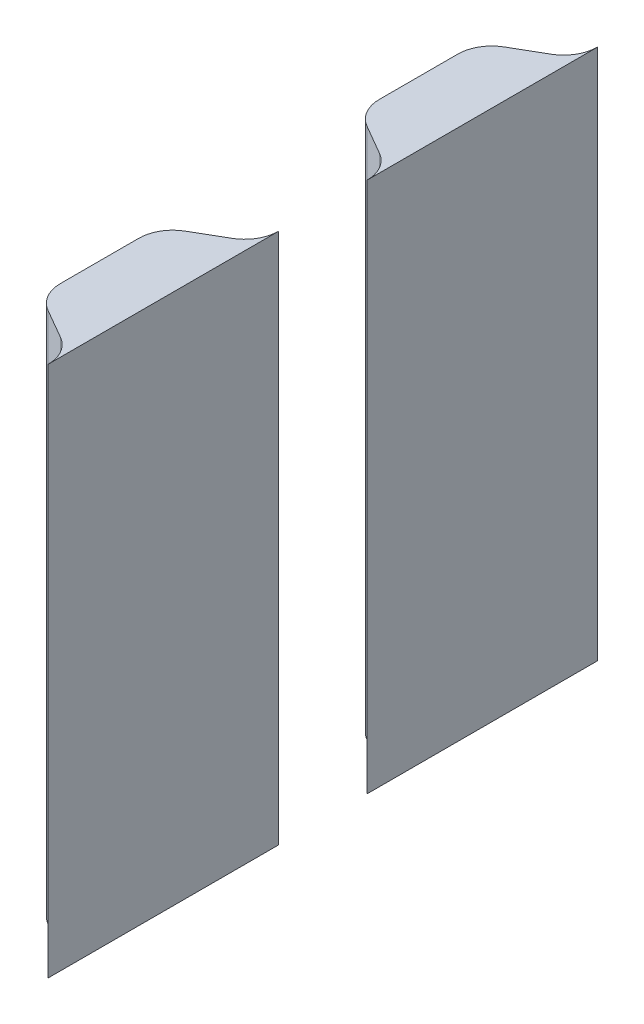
ISO-10303-21;
HEADER;
FILE_DESCRIPTION(('STEP AP214'),'2;1');
FILE_NAME('part.step','',(''),(''),'','','');
FILE_SCHEMA(('AUTOMOTIVE_DESIGN { 1 0 10303 214 1 1 1 1 }'));
ENDSEC;
DATA;
#1=APPLICATION_CONTEXT('core data for automotive mechanical design processes');
#2=APPLICATION_PROTOCOL_DEFINITION('international standard','automotive_design',2000,#1);
#3=PRODUCT_CONTEXT('',#1,'mechanical');
#4=PRODUCT('Part','Part','',(#3));
#5=PRODUCT_RELATED_PRODUCT_CATEGORY('part','',(#4));
#6=PRODUCT_DEFINITION_FORMATION('','',#4);
#7=PRODUCT_DEFINITION_CONTEXT('part definition',#1,'design');
#8=PRODUCT_DEFINITION('design','',#6,#7);
#9=PRODUCT_DEFINITION_SHAPE('','',#8);
#10=(LENGTH_UNIT() NAMED_UNIT(*) SI_UNIT(.MILLI.,.METRE.));
#11=(NAMED_UNIT(*) PLANE_ANGLE_UNIT() SI_UNIT($,.RADIAN.));
#12=(NAMED_UNIT(*) SI_UNIT($,.STERADIAN.) SOLID_ANGLE_UNIT());
#13=UNCERTAINTY_MEASURE_WITH_UNIT(LENGTH_MEASURE(1.E-05),#10,'distance_accuracy_value','');
#14=(GEOMETRIC_REPRESENTATION_CONTEXT(3) GLOBAL_UNCERTAINTY_ASSIGNED_CONTEXT((#13)) GLOBAL_UNIT_ASSIGNED_CONTEXT((#10,
#11,#12)) REPRESENTATION_CONTEXT('',''));
#15=CARTESIAN_POINT('',(0.,0.,0.));
#16=DIRECTION('',(0.,0.,1.));
#17=DIRECTION('',(1.,0.,0.));
#18=AXIS2_PLACEMENT_3D('',#15,#16,#17);
#19=CARTESIAN_POINT('',(46.0089834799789,25.,-26.1067492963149));
#20=DIRECTION('',(0.501345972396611,0.,-0.865246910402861));
#21=DIRECTION('',(-0.865246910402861,0.,-0.501345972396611));
#22=AXIS2_PLACEMENT_3D('',#19,#20,#21);
#23=PLANE('',#22);
#24=DIRECTION('',(0.865246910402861,0.,0.501345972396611));
#25=VECTOR('',#24,1.);
#26=CARTESIAN_POINT('',(46.0089834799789,0.,-26.1067492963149));
#27=LINE('',#26,#25);
#28=CARTESIAN_POINT('',(57.7978464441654,0.,-19.2759835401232));
#29=VERTEX_POINT('',#28);
#30=CARTESIAN_POINT('',(59.2021535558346,0.,-18.4622924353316));
#31=VERTEX_POINT('',#30);
#32=EDGE_CURVE('E104',#29,#31,#27,.T.);
#33=ORIENTED_EDGE('',*,*,#32,.T.);
#34=DIRECTION('',(0.,-1.,0.));
#35=VECTOR('',#34,1.);
#36=CARTESIAN_POINT('',(59.2021535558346,25.,-18.4622924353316));
#37=LINE('',#36,#35);
#38=CARTESIAN_POINT('',(59.2021535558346,25.,-18.4622924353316));
#39=VERTEX_POINT('',#38);
#40=EDGE_CURVE('E12',#39,#31,#37,.T.);
#41=ORIENTED_EDGE('',*,*,#40,.F.);
#42=DIRECTION('',(0.865246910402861,0.,0.501345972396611));
#43=VECTOR('',#42,1.);
#44=CARTESIAN_POINT('',(46.0089834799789,25.,-26.1067492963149));
#45=LINE('',#44,#43);
#46=CARTESIAN_POINT('',(57.7978464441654,25.,-19.2759835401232));
#47=VERTEX_POINT('',#46);
#48=EDGE_CURVE('E131',#47,#39,#45,.T.);
#49=ORIENTED_EDGE('',*,*,#48,.F.);
#50=DIRECTION('',(0.,-1.,0.));
#51=VECTOR('',#50,1.);
#52=CARTESIAN_POINT('',(57.7978464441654,25.,-19.2759835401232));
#53=LINE('',#52,#51);
#54=EDGE_CURVE('E117',#47,#29,#53,.T.);
#55=ORIENTED_EDGE('',*,*,#54,.T.);
#56=EDGE_LOOP('',(#33,#41,#49,#55));
#57=FACE_BOUND('',#56,.T.);
#58=ADVANCED_FACE('F36',(#57),#23,.F.);
#59=CARTESIAN_POINT('',(58.4,25.,-17.077897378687));
#60=DIRECTION('',(0.,-1.,0.));
#61=DIRECTION('',(0.,0.,-1.));
#62=AXIS2_PLACEMENT_3D('',#59,#60,#61);
#63=CYLINDRICAL_SURFACE('',#62,1.6);
#64=CARTESIAN_POINT('',(58.4,0.,-17.077897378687));
#65=DIRECTION('',(0.,1.,0.));
#66=DIRECTION('',(0.,0.,1.));
#67=AXIS2_PLACEMENT_3D('',#64,#65,#66);
#68=CIRCLE('',#67,1.6);
#69=CARTESIAN_POINT('',(60.,0.,-17.077897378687));
#70=VERTEX_POINT('',#69);
#71=EDGE_CURVE('E100',#31,#70,#68,.F.);
#72=ORIENTED_EDGE('',*,*,#71,.T.);
#73=DIRECTION('',(0.,-1.,0.));
#74=VECTOR('',#73,1.);
#75=CARTESIAN_POINT('',(60.,25.,-17.077897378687));
#76=LINE('',#75,#74);
#77=CARTESIAN_POINT('',(60.,25.,-17.077897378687));
#78=VERTEX_POINT('',#77);
#79=EDGE_CURVE('E43',#78,#70,#76,.T.);
#80=ORIENTED_EDGE('',*,*,#79,.F.);
#81=CARTESIAN_POINT('',(58.4,25.,-17.077897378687));
#82=DIRECTION('',(0.,1.,0.));
#83=DIRECTION('',(0.,0.,1.));
#84=AXIS2_PLACEMENT_3D('',#81,#82,#83);
#85=CIRCLE('',#84,1.6);
#86=EDGE_CURVE('E113',#39,#78,#85,.F.);
#87=ORIENTED_EDGE('',*,*,#86,.F.);
#88=ORIENTED_EDGE('',*,*,#40,.T.);
#89=EDGE_LOOP('',(#72,#80,#87,#88));
#90=FACE_BOUND('',#89,.T.);
#91=ADVANCED_FACE('F112',(#90),#63,.F.);
#92=CARTESIAN_POINT('',(60.,25.,-14.9999401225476));
#93=DIRECTION('',(-1.,0.,0.));
#94=DIRECTION('',(0.,0.,1.));
#95=AXIS2_PLACEMENT_3D('',#92,#93,#94);
#96=PLANE('',#95);
#97=DIRECTION('',(0.,0.,-1.));
#98=VECTOR('',#97,1.);
#99=CARTESIAN_POINT('',(60.,0.,-14.9999401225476));
#100=LINE('',#99,#98);
#101=CARTESIAN_POINT('',(60.,0.,-27.9237604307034));
#102=VERTEX_POINT('',#101);
#103=EDGE_CURVE('E106',#70,#102,#100,.T.);
#104=ORIENTED_EDGE('',*,*,#103,.T.);
#105=DIRECTION('',(0.,-1.,0.));
#106=VECTOR('',#105,1.);
#107=CARTESIAN_POINT('',(60.,25.,-27.9237604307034));
#108=LINE('',#107,#106);
#109=CARTESIAN_POINT('',(60.,25.,-27.9237604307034));
#110=VERTEX_POINT('',#109);
#111=EDGE_CURVE('E157',#110,#102,#108,.T.);
#112=ORIENTED_EDGE('',*,*,#111,.F.);
#113=DIRECTION('',(0.,0.,-1.));
#114=VECTOR('',#113,1.);
#115=CARTESIAN_POINT('',(60.,25.,-14.9999401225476));
#116=LINE('',#115,#114);
#117=EDGE_CURVE('E134',#78,#110,#116,.T.);
#118=ORIENTED_EDGE('',*,*,#117,.F.);
#119=ORIENTED_EDGE('',*,*,#79,.T.);
#120=EDGE_LOOP('',(#104,#112,#118,#119));
#121=FACE_BOUND('',#120,.T.);
#122=ADVANCED_FACE('F161',(#121),#96,.F.);
#123=CARTESIAN_POINT('',(58.4,25.,-27.9237604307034));
#124=DIRECTION('',(0.,-1.,0.));
#125=DIRECTION('',(0.,0.,-1.));
#126=AXIS2_PLACEMENT_3D('',#123,#124,#125);
#127=CYLINDRICAL_SURFACE('',#126,1.6);
#128=CARTESIAN_POINT('',(58.4,0.,-27.9237604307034));
#129=DIRECTION('',(0.,1.,0.));
#130=DIRECTION('',(0.,0.,1.));
#131=AXIS2_PLACEMENT_3D('',#128,#129,#130);
#132=CIRCLE('',#131,1.6);
#133=CARTESIAN_POINT('',(59.2,0.,-26.5381197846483));
#134=VERTEX_POINT('',#133);
#135=EDGE_CURVE('E121',#102,#134,#132,.F.);
#136=ORIENTED_EDGE('',*,*,#135,.T.);
#137=DIRECTION('',(0.,-1.,0.));
#138=VECTOR('',#137,1.);
#139=CARTESIAN_POINT('',(59.2,25.,-26.5381197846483));
#140=LINE('',#139,#138);
#141=CARTESIAN_POINT('',(59.2,25.,-26.5381197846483));
#142=VERTEX_POINT('',#141);
#143=EDGE_CURVE('E154',#142,#134,#140,.T.);
#144=ORIENTED_EDGE('',*,*,#143,.F.);
#145=CARTESIAN_POINT('',(58.4,25.,-27.9237604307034));
#146=DIRECTION('',(0.,1.,0.));
#147=DIRECTION('',(0.,0.,1.));
#148=AXIS2_PLACEMENT_3D('',#145,#146,#147);
#149=CIRCLE('',#148,1.6);
#150=EDGE_CURVE('E136',#110,#142,#149,.F.);
#151=ORIENTED_EDGE('',*,*,#150,.F.);
#152=ORIENTED_EDGE('',*,*,#111,.T.);
#153=EDGE_LOOP('',(#136,#144,#151,#152));
#154=FACE_BOUND('',#153,.T.);
#155=ADVANCED_FACE('F169',(#154),#127,.F.);
#156=CARTESIAN_POINT('',(39.4838843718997,25.,-15.1550151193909));
#157=DIRECTION('',(0.5,0.,0.866025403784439));
#158=DIRECTION('',(0.866025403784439,0.,-0.5));
#159=AXIS2_PLACEMENT_3D('',#156,#157,#158);
#160=PLANE('',#159);
#161=DIRECTION('',(-0.866025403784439,0.,0.5));
#162=VECTOR('',#161,1.);
#163=CARTESIAN_POINT('',(39.4838843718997,0.,-15.1550151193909));
#164=LINE('',#163,#162);
#165=CARTESIAN_POINT('',(57.8,0.,-25.7298294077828));
#166=VERTEX_POINT('',#165);
#167=EDGE_CURVE('E123',#134,#166,#164,.T.);
#168=ORIENTED_EDGE('',*,*,#167,.T.);
#169=DIRECTION('',(0.,-1.,0.));
#170=VECTOR('',#169,1.);
#171=CARTESIAN_POINT('',(57.8,25.,-25.7298294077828));
#172=LINE('',#171,#170);
#173=CARTESIAN_POINT('',(57.8,25.,-25.7298294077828));
#174=VERTEX_POINT('',#173);
#175=EDGE_CURVE('E151',#174,#166,#172,.T.);
#176=ORIENTED_EDGE('',*,*,#175,.F.);
#177=DIRECTION('',(-0.866025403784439,0.,0.5));
#178=VECTOR('',#177,1.);
#179=CARTESIAN_POINT('',(39.4838843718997,25.,-15.1550151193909));
#180=LINE('',#179,#178);
#181=EDGE_CURVE('E138',#142,#174,#180,.T.);
#182=ORIENTED_EDGE('',*,*,#181,.F.);
#183=ORIENTED_EDGE('',*,*,#143,.T.);
#184=EDGE_LOOP('',(#168,#176,#182,#183));
#185=FACE_BOUND('',#184,.T.);
#186=ADVANCED_FACE('F172',(#185),#160,.F.);
#187=CARTESIAN_POINT('',(58.6,25.,-24.3441887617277));
#188=DIRECTION('',(0.,-1.,0.));
#189=DIRECTION('',(0.,0.,-1.));
#190=AXIS2_PLACEMENT_3D('',#187,#188,#189);
#191=CYLINDRICAL_SURFACE('',#190,1.6);
#192=CARTESIAN_POINT('',(58.6,0.,-24.3441887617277));
#193=DIRECTION('',(0.,1.,0.));
#194=DIRECTION('',(0.,0.,1.));
#195=AXIS2_PLACEMENT_3D('',#192,#193,#194);
#196=CIRCLE('',#195,1.6);
#197=CARTESIAN_POINT('',(57.,0.,-24.3441887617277));
#198=VERTEX_POINT('',#197);
#199=EDGE_CURVE('E125',#166,#198,#196,.T.);
#200=ORIENTED_EDGE('',*,*,#199,.T.);
#201=DIRECTION('',(0.,-1.,0.));
#202=VECTOR('',#201,1.);
#203=CARTESIAN_POINT('',(57.,25.,-24.3441887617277));
#204=LINE('',#203,#202);
#205=CARTESIAN_POINT('',(57.,25.,-24.3441887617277));
#206=VERTEX_POINT('',#205);
#207=EDGE_CURVE('E148',#206,#198,#204,.T.);
#208=ORIENTED_EDGE('',*,*,#207,.F.);
#209=CARTESIAN_POINT('',(58.6,25.,-24.3441887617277));
#210=DIRECTION('',(0.,1.,0.));
#211=DIRECTION('',(0.,0.,1.));
#212=AXIS2_PLACEMENT_3D('',#209,#210,#211);
#213=CIRCLE('',#212,1.6);
#214=EDGE_CURVE('E140',#174,#206,#213,.T.);
#215=ORIENTED_EDGE('',*,*,#214,.F.);
#216=ORIENTED_EDGE('',*,*,#175,.T.);
#217=EDGE_LOOP('',(#200,#208,#215,#216));
#218=FACE_BOUND('',#217,.T.);
#219=ADVANCED_FACE('F177',(#218),#191,.T.);
#220=CARTESIAN_POINT('',(57.,25.,-14.9999401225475));
#221=DIRECTION('',(1.,0.,0.));
#222=DIRECTION('',(0.,0.,-1.));
#223=AXIS2_PLACEMENT_3D('',#220,#221,#222);
#224=PLANE('',#223);
#225=DIRECTION('',(0.,0.,1.));
#226=VECTOR('',#225,1.);
#227=CARTESIAN_POINT('',(57.,0.,-14.9999401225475));
#228=LINE('',#227,#226);
#229=CARTESIAN_POINT('',(57.,0.,-20.6603785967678));
#230=VERTEX_POINT('',#229);
#231=EDGE_CURVE('E127',#198,#230,#228,.T.);
#232=ORIENTED_EDGE('',*,*,#231,.T.);
#233=DIRECTION('',(0.,-1.,0.));
#234=VECTOR('',#233,1.);
#235=CARTESIAN_POINT('',(57.,25.,-20.6603785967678));
#236=LINE('',#235,#234);
#237=CARTESIAN_POINT('',(57.,25.,-20.6603785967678));
#238=VERTEX_POINT('',#237);
#239=EDGE_CURVE('E145',#238,#230,#236,.T.);
#240=ORIENTED_EDGE('',*,*,#239,.F.);
#241=DIRECTION('',(0.,0.,1.));
#242=VECTOR('',#241,1.);
#243=CARTESIAN_POINT('',(57.,25.,-14.9999401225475));
#244=LINE('',#243,#242);
#245=EDGE_CURVE('E55',#206,#238,#244,.T.);
#246=ORIENTED_EDGE('',*,*,#245,.F.);
#247=ORIENTED_EDGE('',*,*,#207,.T.);
#248=EDGE_LOOP('',(#232,#240,#246,#247));
#249=FACE_BOUND('',#248,.T.);
#250=ADVANCED_FACE('F180',(#249),#224,.F.);
#251=CARTESIAN_POINT('',(58.6,25.,-20.6603785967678));
#252=DIRECTION('',(0.,-1.,0.));
#253=DIRECTION('',(0.,0.,-1.));
#254=AXIS2_PLACEMENT_3D('',#251,#252,#253);
#255=CYLINDRICAL_SURFACE('',#254,1.6);
#256=CARTESIAN_POINT('',(58.6,0.,-20.6603785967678));
#257=DIRECTION('',(0.,1.,0.));
#258=DIRECTION('',(0.,0.,1.));
#259=AXIS2_PLACEMENT_3D('',#256,#257,#258);
#260=CIRCLE('',#259,1.6);
#261=EDGE_CURVE('E129',#230,#29,#260,.T.);
#262=ORIENTED_EDGE('',*,*,#261,.T.);
#263=ORIENTED_EDGE('',*,*,#54,.F.);
#264=CARTESIAN_POINT('',(58.6,25.,-20.6603785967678));
#265=DIRECTION('',(0.,1.,0.));
#266=DIRECTION('',(0.,0.,1.));
#267=AXIS2_PLACEMENT_3D('',#264,#265,#266);
#268=CIRCLE('',#267,1.6);
#269=EDGE_CURVE('E50',#238,#47,#268,.T.);
#270=ORIENTED_EDGE('',*,*,#269,.F.);
#271=ORIENTED_EDGE('',*,*,#239,.T.);
#272=EDGE_LOOP('',(#262,#263,#270,#271));
#273=FACE_BOUND('',#272,.T.);
#274=ADVANCED_FACE('F182',(#273),#255,.T.);
#275=CARTESIAN_POINT('',(39.5734169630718,25.,-14.9999401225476));
#276=DIRECTION('',(0.,1.,0.));
#277=DIRECTION('',(0.,0.,1.));
#278=AXIS2_PLACEMENT_3D('',#275,#276,#277);
#279=PLANE('',#278);
#280=ORIENTED_EDGE('',*,*,#48,.T.);
#281=ORIENTED_EDGE('',*,*,#86,.T.);
#282=ORIENTED_EDGE('',*,*,#117,.T.);
#283=ORIENTED_EDGE('',*,*,#150,.T.);
#284=ORIENTED_EDGE('',*,*,#181,.T.);
#285=ORIENTED_EDGE('',*,*,#214,.T.);
#286=ORIENTED_EDGE('',*,*,#245,.T.);
#287=ORIENTED_EDGE('',*,*,#269,.T.);
#288=EDGE_LOOP('',(#280,#281,#282,#283,#284,#285,#286,#287));
#289=FACE_BOUND('',#288,.T.);
#290=ADVANCED_FACE('F164',(#289),#279,.T.);
#291=CARTESIAN_POINT('',(39.5734169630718,0.,-14.9999401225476));
#292=DIRECTION('',(0.,1.,0.));
#293=DIRECTION('',(0.,0.,1.));
#294=AXIS2_PLACEMENT_3D('',#291,#292,#293);
#295=PLANE('',#294);
#296=ORIENTED_EDGE('',*,*,#32,.F.);
#297=ORIENTED_EDGE('',*,*,#261,.F.);
#298=ORIENTED_EDGE('',*,*,#231,.F.);
#299=ORIENTED_EDGE('',*,*,#199,.F.);
#300=ORIENTED_EDGE('',*,*,#167,.F.);
#301=ORIENTED_EDGE('',*,*,#135,.F.);
#302=ORIENTED_EDGE('',*,*,#103,.F.);
#303=ORIENTED_EDGE('',*,*,#71,.F.);
#304=EDGE_LOOP('',(#296,#297,#298,#299,#300,#301,#302,#303));
#305=FACE_BOUND('',#304,.T.);
#306=ADVANCED_FACE('F101',(#305),#295,.F.);
#307=CLOSED_SHELL('',(#58,#91,#122,#155,#186,#219,#250,#274,#290,#306));
#308=MANIFOLD_SOLID_BREP('B2',#307);
#309=CARTESIAN_POINT('',(58.6,25.,-9.33962140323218));
#310=DIRECTION('',(0.,-1.,0.));
#311=DIRECTION('',(0.,0.,-1.));
#312=AXIS2_PLACEMENT_3D('',#309,#310,#311);
#313=CYLINDRICAL_SURFACE('',#312,1.6);
#314=CARTESIAN_POINT('',(58.6,0.,-9.33962140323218));
#315=DIRECTION('',(0.,1.,0.));
#316=DIRECTION('',(0.,0.,1.));
#317=AXIS2_PLACEMENT_3D('',#314,#315,#316);
#318=CIRCLE('',#317,1.6);
#319=CARTESIAN_POINT('',(57.,0.,-9.33962140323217));
#320=VERTEX_POINT('',#319);
#321=CARTESIAN_POINT('',(57.7978464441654,0.,-10.7240164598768));
#322=VERTEX_POINT('',#321);
#323=EDGE_CURVE('E318',#320,#322,#318,.F.);
#324=ORIENTED_EDGE('',*,*,#323,.F.);
#325=DIRECTION('',(0.,-1.,0.));
#326=VECTOR('',#325,1.);
#327=CARTESIAN_POINT('',(57.,25.,-9.33962140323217));
#328=LINE('',#327,#326);
#329=CARTESIAN_POINT('',(57.,25.,-9.33962140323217));
#330=VERTEX_POINT('',#329);
#331=EDGE_CURVE('E34',#330,#320,#328,.T.);
#332=ORIENTED_EDGE('',*,*,#331,.F.);
#333=CARTESIAN_POINT('',(58.6,25.,-9.33962140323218));
#334=DIRECTION('',(0.,1.,0.));
#335=DIRECTION('',(0.,0.,1.));
#336=AXIS2_PLACEMENT_3D('',#333,#334,#335);
#337=CIRCLE('',#336,1.6);
#338=CARTESIAN_POINT('',(57.7978464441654,25.,-10.7240164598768));
#339=VERTEX_POINT('',#338);
#340=EDGE_CURVE('E342',#330,#339,#337,.F.);
#341=ORIENTED_EDGE('',*,*,#340,.T.);
#342=DIRECTION('',(0.,-1.,0.));
#343=VECTOR('',#342,1.);
#344=CARTESIAN_POINT('',(57.7978464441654,25.,-10.7240164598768));
#345=LINE('',#344,#343);
#346=EDGE_CURVE('E257',#339,#322,#345,.T.);
#347=ORIENTED_EDGE('',*,*,#346,.T.);
#348=EDGE_LOOP('',(#324,#332,#341,#347));
#349=FACE_BOUND('',#348,.T.);
#350=ADVANCED_FACE('F243',(#349),#313,.T.);
#351=CARTESIAN_POINT('',(57.,25.,-14.9999401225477));
#352=DIRECTION('',(-1.,0.,0.));
#353=DIRECTION('',(0.,0.,1.));
#354=AXIS2_PLACEMENT_3D('',#351,#352,#353);
#355=PLANE('',#354);
#356=DIRECTION('',(0.,0.,-1.));
#357=VECTOR('',#356,1.);
#358=CARTESIAN_POINT('',(57.,0.,-14.9999401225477));
#359=LINE('',#358,#357);
#360=CARTESIAN_POINT('',(57.,0.,-5.65581123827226));
#361=VERTEX_POINT('',#360);
#362=EDGE_CURVE('E311',#361,#320,#359,.T.);
#363=ORIENTED_EDGE('',*,*,#362,.F.);
#364=DIRECTION('',(0.,-1.,0.));
#365=VECTOR('',#364,1.);
#366=CARTESIAN_POINT('',(57.,25.,-5.65581123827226));
#367=LINE('',#366,#365);
#368=CARTESIAN_POINT('',(57.,25.,-5.65581123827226));
#369=VERTEX_POINT('',#368);
#370=EDGE_CURVE('E250',#369,#361,#367,.T.);
#371=ORIENTED_EDGE('',*,*,#370,.F.);
#372=DIRECTION('',(0.,0.,-1.));
#373=VECTOR('',#372,1.);
#374=CARTESIAN_POINT('',(57.,25.,-14.9999401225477));
#375=LINE('',#374,#373);
#376=EDGE_CURVE('E314',#369,#330,#375,.T.);
#377=ORIENTED_EDGE('',*,*,#376,.T.);
#378=ORIENTED_EDGE('',*,*,#331,.T.);
#379=EDGE_LOOP('',(#363,#371,#377,#378));
#380=FACE_BOUND('',#379,.T.);
#381=ADVANCED_FACE('F309',(#380),#355,.T.);
#382=CARTESIAN_POINT('',(58.6,25.,-5.65581123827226));
#383=DIRECTION('',(0.,-1.,0.));
#384=DIRECTION('',(0.,0.,-1.));
#385=AXIS2_PLACEMENT_3D('',#382,#383,#384);
#386=CYLINDRICAL_SURFACE('',#385,1.59999999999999);
#387=CARTESIAN_POINT('',(58.6,0.,-5.65581123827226));
#388=DIRECTION('',(0.,1.,0.));
#389=DIRECTION('',(0.,0.,1.));
#390=AXIS2_PLACEMENT_3D('',#387,#388,#389);
#391=CIRCLE('',#390,1.59999999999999);
#392=CARTESIAN_POINT('',(57.8,0.,-4.27017059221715));
#393=VERTEX_POINT('',#392);
#394=EDGE_CURVE('E325',#393,#361,#391,.F.);
#395=ORIENTED_EDGE('',*,*,#394,.F.);
#396=DIRECTION('',(0.,-1.,0.));
#397=VECTOR('',#396,1.);
#398=CARTESIAN_POINT('',(57.8,25.,-4.27017059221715));
#399=LINE('',#398,#397);
#400=CARTESIAN_POINT('',(57.8,25.,-4.27017059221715));
#401=VERTEX_POINT('',#400);
#402=EDGE_CURVE('E368',#401,#393,#399,.T.);
#403=ORIENTED_EDGE('',*,*,#402,.F.);
#404=CARTESIAN_POINT('',(58.6,25.,-5.65581123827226));
#405=DIRECTION('',(0.,1.,0.));
#406=DIRECTION('',(0.,0.,1.));
#407=AXIS2_PLACEMENT_3D('',#404,#405,#406);
#408=CIRCLE('',#407,1.59999999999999);
#409=EDGE_CURVE('E345',#401,#369,#408,.F.);
#410=ORIENTED_EDGE('',*,*,#409,.T.);
#411=ORIENTED_EDGE('',*,*,#370,.T.);
#412=EDGE_LOOP('',(#395,#403,#410,#411));
#413=FACE_BOUND('',#412,.T.);
#414=ADVANCED_FACE('F370',(#413),#386,.T.);
#415=CARTESIAN_POINT('',(39.4839362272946,25.,-14.8449549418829));
#416=DIRECTION('',(-0.499999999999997,0.,0.866025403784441));
#417=DIRECTION('',(0.866025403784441,0.,0.499999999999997));
#418=AXIS2_PLACEMENT_3D('',#415,#416,#417);
#419=PLANE('',#418);
#420=DIRECTION('',(-0.866025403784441,0.,-0.499999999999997));
#421=VECTOR('',#420,1.);
#422=CARTESIAN_POINT('',(39.4839362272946,0.,-14.8449549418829));
#423=LINE('',#422,#421);
#424=CARTESIAN_POINT('',(59.2,0.,-3.4618802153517));
#425=VERTEX_POINT('',#424);
#426=EDGE_CURVE('E327',#425,#393,#423,.T.);
#427=ORIENTED_EDGE('',*,*,#426,.F.);
#428=DIRECTION('',(0.,-1.,0.));
#429=VECTOR('',#428,1.);
#430=CARTESIAN_POINT('',(59.2,25.,-3.4618802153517));
#431=LINE('',#430,#429);
#432=CARTESIAN_POINT('',(59.2,25.,-3.4618802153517));
#433=VERTEX_POINT('',#432);
#434=EDGE_CURVE('E366',#433,#425,#431,.T.);
#435=ORIENTED_EDGE('',*,*,#434,.F.);
#436=DIRECTION('',(-0.866025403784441,0.,-0.499999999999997));
#437=VECTOR('',#436,1.);
#438=CARTESIAN_POINT('',(39.4839362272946,25.,-14.8449549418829));
#439=LINE('',#438,#437);
#440=EDGE_CURVE('E348',#433,#401,#439,.T.);
#441=ORIENTED_EDGE('',*,*,#440,.T.);
#442=ORIENTED_EDGE('',*,*,#402,.T.);
#443=EDGE_LOOP('',(#427,#435,#441,#442));
#444=FACE_BOUND('',#443,.T.);
#445=ADVANCED_FACE('F388',(#444),#419,.T.);
#446=CARTESIAN_POINT('',(58.4,25.,-2.07623956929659));
#447=DIRECTION('',(0.,-1.,0.));
#448=DIRECTION('',(0.,0.,-1.));
#449=AXIS2_PLACEMENT_3D('',#446,#447,#448);
#450=CYLINDRICAL_SURFACE('',#449,1.6);
#451=CARTESIAN_POINT('',(58.4,0.,-2.07623956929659));
#452=DIRECTION('',(0.,1.,0.));
#453=DIRECTION('',(0.,0.,1.));
#454=AXIS2_PLACEMENT_3D('',#451,#452,#453);
#455=CIRCLE('',#454,1.6);
#456=CARTESIAN_POINT('',(60.,0.,-2.07623956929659));
#457=VERTEX_POINT('',#456);
#458=EDGE_CURVE('E331',#457,#425,#455,.T.);
#459=ORIENTED_EDGE('',*,*,#458,.F.);
#460=DIRECTION('',(0.,-1.,0.));
#461=VECTOR('',#460,1.);
#462=CARTESIAN_POINT('',(60.,25.,-2.07623956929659));
#463=LINE('',#462,#461);
#464=CARTESIAN_POINT('',(60.,25.,-2.07623956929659));
#465=VERTEX_POINT('',#464);
#466=EDGE_CURVE('E364',#465,#457,#463,.T.);
#467=ORIENTED_EDGE('',*,*,#466,.F.);
#468=CARTESIAN_POINT('',(58.4,25.,-2.07623956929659));
#469=DIRECTION('',(0.,1.,0.));
#470=DIRECTION('',(0.,0.,1.));
#471=AXIS2_PLACEMENT_3D('',#468,#469,#470);
#472=CIRCLE('',#471,1.6);
#473=EDGE_CURVE('E351',#465,#433,#472,.T.);
#474=ORIENTED_EDGE('',*,*,#473,.T.);
#475=ORIENTED_EDGE('',*,*,#434,.T.);
#476=EDGE_LOOP('',(#459,#467,#474,#475));
#477=FACE_BOUND('',#476,.T.);
#478=ADVANCED_FACE('F383',(#477),#450,.F.);
#479=CARTESIAN_POINT('',(60.,25.,-14.9999401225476));
#480=DIRECTION('',(-1.,0.,0.));
#481=DIRECTION('',(0.,0.,1.));
#482=AXIS2_PLACEMENT_3D('',#479,#480,#481);
#483=PLANE('',#482);
#484=DIRECTION('',(0.,0.,-1.));
#485=VECTOR('',#484,1.);
#486=CARTESIAN_POINT('',(60.,0.,-14.9999401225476));
#487=LINE('',#486,#485);
#488=CARTESIAN_POINT('',(60.,0.,-12.922102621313));
#489=VERTEX_POINT('',#488);
#490=EDGE_CURVE('E334',#457,#489,#487,.T.);
#491=ORIENTED_EDGE('',*,*,#490,.T.);
#492=DIRECTION('',(0.,-1.,0.));
#493=VECTOR('',#492,1.);
#494=CARTESIAN_POINT('',(60.,25.,-12.922102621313));
#495=LINE('',#494,#493);
#496=CARTESIAN_POINT('',(60.,25.,-12.922102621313));
#497=VERTEX_POINT('',#496);
#498=EDGE_CURVE('E362',#497,#489,#495,.T.);
#499=ORIENTED_EDGE('',*,*,#498,.F.);
#500=DIRECTION('',(0.,0.,-1.));
#501=VECTOR('',#500,1.);
#502=CARTESIAN_POINT('',(60.,25.,-14.9999401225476));
#503=LINE('',#502,#501);
#504=EDGE_CURVE('E354',#465,#497,#503,.T.);
#505=ORIENTED_EDGE('',*,*,#504,.F.);
#506=ORIENTED_EDGE('',*,*,#466,.T.);
#507=EDGE_LOOP('',(#491,#499,#505,#506));
#508=FACE_BOUND('',#507,.T.);
#509=ADVANCED_FACE('F389',(#508),#483,.F.);
#510=CARTESIAN_POINT('',(58.4,25.,-12.922102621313));
#511=DIRECTION('',(0.,-1.,0.));
#512=DIRECTION('',(0.,0.,-1.));
#513=AXIS2_PLACEMENT_3D('',#510,#511,#512);
#514=CYLINDRICAL_SURFACE('',#513,1.6);
#515=CARTESIAN_POINT('',(58.4,0.,-12.922102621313));
#516=DIRECTION('',(0.,1.,0.));
#517=DIRECTION('',(0.,0.,1.));
#518=AXIS2_PLACEMENT_3D('',#515,#516,#517);
#519=CIRCLE('',#518,1.6);
#520=CARTESIAN_POINT('',(59.2021535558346,0.,-11.5377075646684));
#521=VERTEX_POINT('',#520);
#522=EDGE_CURVE('E337',#521,#489,#519,.T.);
#523=ORIENTED_EDGE('',*,*,#522,.F.);
#524=DIRECTION('',(0.,-1.,0.));
#525=VECTOR('',#524,1.);
#526=CARTESIAN_POINT('',(59.2021535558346,25.,-11.5377075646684));
#527=LINE('',#526,#525);
#528=CARTESIAN_POINT('',(59.2021535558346,25.,-11.5377075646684));
#529=VERTEX_POINT('',#528);
#530=EDGE_CURVE('E265',#529,#521,#527,.T.);
#531=ORIENTED_EDGE('',*,*,#530,.F.);
#532=CARTESIAN_POINT('',(58.4,25.,-12.922102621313));
#533=DIRECTION('',(0.,1.,0.));
#534=DIRECTION('',(0.,0.,1.));
#535=AXIS2_PLACEMENT_3D('',#532,#533,#534);
#536=CIRCLE('',#535,1.6);
#537=EDGE_CURVE('E356',#529,#497,#536,.T.);
#538=ORIENTED_EDGE('',*,*,#537,.T.);
#539=ORIENTED_EDGE('',*,*,#498,.T.);
#540=EDGE_LOOP('',(#523,#531,#538,#539));
#541=FACE_BOUND('',#540,.T.);
#542=ADVANCED_FACE('F377',(#541),#514,.F.);
#543=CARTESIAN_POINT('',(46.0089315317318,25.,-3.89322060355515));
#544=DIRECTION('',(-0.50134597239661,0.,-0.865246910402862));
#545=DIRECTION('',(-0.865246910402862,0.,0.50134597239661));
#546=AXIS2_PLACEMENT_3D('',#543,#544,#545);
#547=PLANE('',#546);
#548=DIRECTION('',(0.865246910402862,0.,-0.50134597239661));
#549=VECTOR('',#548,1.);
#550=CARTESIAN_POINT('',(46.0089315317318,0.,-3.89322060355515));
#551=LINE('',#550,#549);
#552=EDGE_CURVE('E340',#322,#521,#551,.T.);
#553=ORIENTED_EDGE('',*,*,#552,.F.);
#554=ORIENTED_EDGE('',*,*,#346,.F.);
#555=DIRECTION('',(0.865246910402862,0.,-0.50134597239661));
#556=VECTOR('',#555,1.);
#557=CARTESIAN_POINT('',(46.0089315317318,25.,-3.89322060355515));
#558=LINE('',#557,#556);
#559=EDGE_CURVE('E358',#339,#529,#558,.T.);
#560=ORIENTED_EDGE('',*,*,#559,.T.);
#561=ORIENTED_EDGE('',*,*,#530,.T.);
#562=EDGE_LOOP('',(#553,#554,#560,#561));
#563=FACE_BOUND('',#562,.T.);
#564=ADVANCED_FACE('F376',(#563),#547,.T.);
#565=CARTESIAN_POINT('',(39.5734169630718,25.,-14.9999401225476));
#566=DIRECTION('',(0.,1.,0.));
#567=DIRECTION('',(0.,0.,1.));
#568=AXIS2_PLACEMENT_3D('',#565,#566,#567);
#569=PLANE('',#568);
#570=ORIENTED_EDGE('',*,*,#340,.F.);
#571=ORIENTED_EDGE('',*,*,#376,.F.);
#572=ORIENTED_EDGE('',*,*,#409,.F.);
#573=ORIENTED_EDGE('',*,*,#440,.F.);
#574=ORIENTED_EDGE('',*,*,#473,.F.);
#575=ORIENTED_EDGE('',*,*,#504,.T.);
#576=ORIENTED_EDGE('',*,*,#537,.F.);
#577=ORIENTED_EDGE('',*,*,#559,.F.);
#578=EDGE_LOOP('',(#570,#571,#572,#573,#574,#575,#576,#577));
#579=FACE_BOUND('',#578,.T.);
#580=ADVANCED_FACE('F373',(#579),#569,.T.);
#581=CARTESIAN_POINT('',(39.5734169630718,0.,-14.9999401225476));
#582=DIRECTION('',(0.,1.,0.));
#583=DIRECTION('',(0.,0.,1.));
#584=AXIS2_PLACEMENT_3D('',#581,#582,#583);
#585=PLANE('',#584);
#586=ORIENTED_EDGE('',*,*,#323,.T.);
#587=ORIENTED_EDGE('',*,*,#552,.T.);
#588=ORIENTED_EDGE('',*,*,#522,.T.);
#589=ORIENTED_EDGE('',*,*,#490,.F.);
#590=ORIENTED_EDGE('',*,*,#458,.T.);
#591=ORIENTED_EDGE('',*,*,#426,.T.);
#592=ORIENTED_EDGE('',*,*,#394,.T.);
#593=ORIENTED_EDGE('',*,*,#362,.T.);
#594=EDGE_LOOP('',(#586,#587,#588,#589,#590,#591,#592,#593));
#595=FACE_BOUND('',#594,.T.);
#596=ADVANCED_FACE('F322',(#595),#585,.F.);
#597=CLOSED_SHELL('',(#350,#381,#414,#445,#478,#509,#542,#564,#580,#596));
#598=MANIFOLD_SOLID_BREP('B6',#597);
#599=ADVANCED_BREP_SHAPE_REPRESENTATION('',(#18,#308,#598),#14);
#600=SHAPE_DEFINITION_REPRESENTATION(#9,#599);
ENDSEC;
END-ISO-10303-21;
